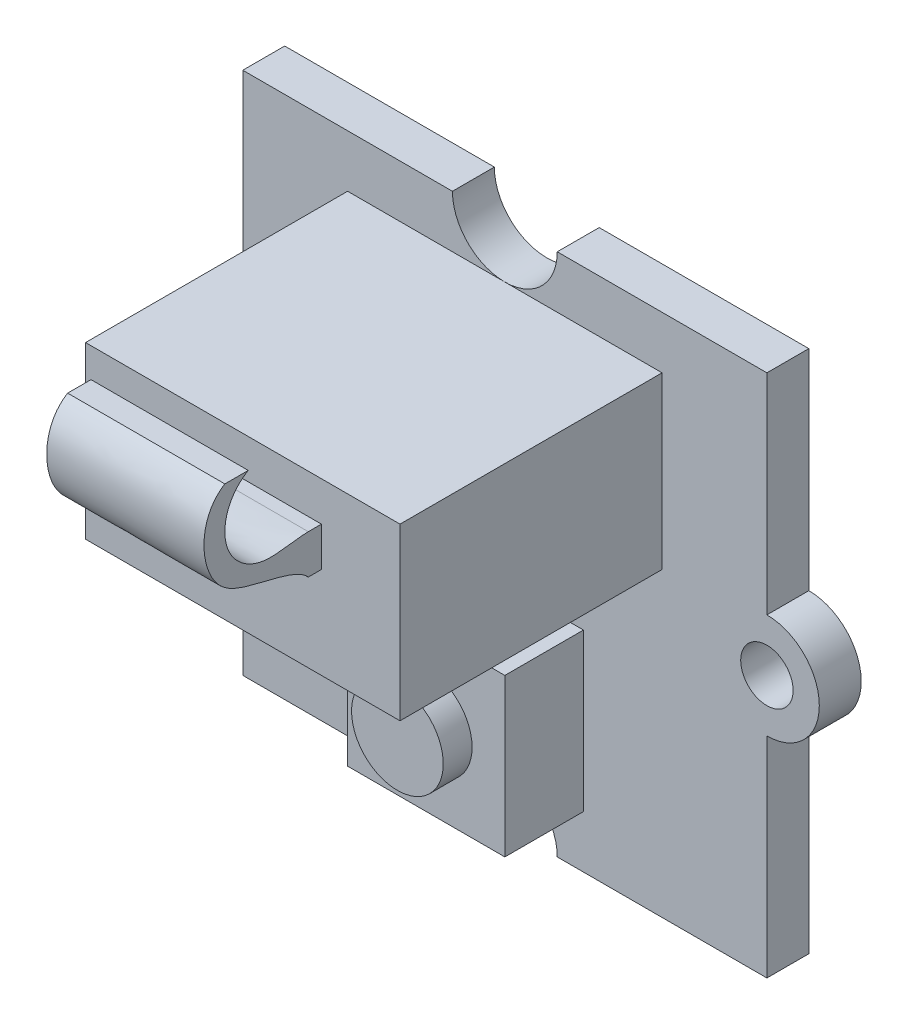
ISO-10303-21;
HEADER;
FILE_DESCRIPTION(('STEP AP214'),'2;1');
FILE_NAME('part.step','',(''),(''),'','','');
FILE_SCHEMA(('AUTOMOTIVE_DESIGN { 1 0 10303 214 1 1 1 1 }'));
ENDSEC;
DATA;
#1=APPLICATION_CONTEXT('core data for automotive mechanical design processes');
#2=APPLICATION_PROTOCOL_DEFINITION('international standard','automotive_design',2000,#1);
#3=PRODUCT_CONTEXT('',#1,'mechanical');
#4=PRODUCT('Part','Part','',(#3));
#5=PRODUCT_RELATED_PRODUCT_CATEGORY('part','',(#4));
#6=PRODUCT_DEFINITION_FORMATION('','',#4);
#7=PRODUCT_DEFINITION_CONTEXT('part definition',#1,'design');
#8=PRODUCT_DEFINITION('design','',#6,#7);
#9=PRODUCT_DEFINITION_SHAPE('','',#8);
#10=(LENGTH_UNIT() NAMED_UNIT(*) SI_UNIT(.MILLI.,.METRE.));
#11=(NAMED_UNIT(*) PLANE_ANGLE_UNIT() SI_UNIT($,.RADIAN.));
#12=(NAMED_UNIT(*) SI_UNIT($,.STERADIAN.) SOLID_ANGLE_UNIT());
#13=UNCERTAINTY_MEASURE_WITH_UNIT(LENGTH_MEASURE(1.E-05),#10,'distance_accuracy_value','');
#14=(GEOMETRIC_REPRESENTATION_CONTEXT(3) GLOBAL_UNCERTAINTY_ASSIGNED_CONTEXT((#13)) GLOBAL_UNIT_ASSIGNED_CONTEXT((#10,
#11,#12)) REPRESENTATION_CONTEXT('',''));
#15=CARTESIAN_POINT('',(0.,0.,0.));
#16=DIRECTION('',(0.,0.,1.));
#17=DIRECTION('',(1.,0.,0.));
#18=AXIS2_PLACEMENT_3D('',#15,#16,#17);
#19=CARTESIAN_POINT('',(0.,0.,11.6));
#20=DIRECTION('',(0.,0.,1.));
#21=DIRECTION('',(1.,0.,0.));
#22=AXIS2_PLACEMENT_3D('',#19,#20,#21);
#23=PLANE('',#22);
#24=DIRECTION('',(0.,-1.,0.));
#25=VECTOR('',#24,1.);
#26=CARTESIAN_POINT('',(-6.,8.,11.6));
#27=LINE('',#26,#25);
#28=CARTESIAN_POINT('',(-6.,8.,11.6));
#29=VERTEX_POINT('',#28);
#30=CARTESIAN_POINT('',(-6.,1.5,11.6));
#31=VERTEX_POINT('',#30);
#32=EDGE_CURVE('E486',#29,#31,#27,.T.);
#33=ORIENTED_EDGE('',*,*,#32,.T.);
#34=DIRECTION('',(1.,0.,0.));
#35=VECTOR('',#34,1.);
#36=CARTESIAN_POINT('',(-6.,1.5,11.6));
#37=LINE('',#36,#35);
#38=CARTESIAN_POINT('',(6.,1.5,11.6));
#39=VERTEX_POINT('',#38);
#40=EDGE_CURVE('E500',#31,#39,#37,.T.);
#41=ORIENTED_EDGE('',*,*,#40,.T.);
#42=DIRECTION('',(0.,1.,0.));
#43=VECTOR('',#42,1.);
#44=CARTESIAN_POINT('',(6.,8.,11.6));
#45=LINE('',#44,#43);
#46=CARTESIAN_POINT('',(6.,8.,11.6));
#47=VERTEX_POINT('',#46);
#48=EDGE_CURVE('E498',#39,#47,#45,.T.);
#49=ORIENTED_EDGE('',*,*,#48,.T.);
#50=DIRECTION('',(-1.,0.,0.));
#51=VECTOR('',#50,1.);
#52=CARTESIAN_POINT('',(-6.,8.,11.6));
#53=LINE('',#52,#51);
#54=EDGE_CURVE('E483',#47,#29,#53,.T.);
#55=ORIENTED_EDGE('',*,*,#54,.T.);
#56=EDGE_LOOP('',(#33,#41,#49,#55));
#57=FACE_BOUND('',#56,.T.);
#58=DIRECTION('',(-1.,0.,0.));
#59=VECTOR('',#58,1.);
#60=CARTESIAN_POINT('',(3.,6.5,11.6));
#61=LINE('',#60,#59);
#62=CARTESIAN_POINT('',(3.,6.5,11.6));
#63=VERTEX_POINT('',#62);
#64=CARTESIAN_POINT('',(-3.,6.5,11.6));
#65=VERTEX_POINT('',#64);
#66=EDGE_CURVE('E50',#63,#65,#61,.T.);
#67=ORIENTED_EDGE('',*,*,#66,.F.);
#68=DIRECTION('',(0.,-1.,0.));
#69=VECTOR('',#68,1.);
#70=CARTESIAN_POINT('',(3.,6.5,11.6));
#71=LINE('',#70,#69);
#72=CARTESIAN_POINT('',(3.,5.,11.6));
#73=VERTEX_POINT('',#72);
#74=EDGE_CURVE('E54',#63,#73,#71,.T.);
#75=ORIENTED_EDGE('',*,*,#74,.T.);
#76=DIRECTION('',(-1.,0.,0.));
#77=VECTOR('',#76,1.);
#78=CARTESIAN_POINT('',(3.,5.,11.6));
#79=LINE('',#78,#77);
#80=CARTESIAN_POINT('',(-3.,5.,11.6));
#81=VERTEX_POINT('',#80);
#82=EDGE_CURVE('E223',#73,#81,#79,.T.);
#83=ORIENTED_EDGE('',*,*,#82,.T.);
#84=DIRECTION('',(0.,-1.,0.));
#85=VECTOR('',#84,1.);
#86=CARTESIAN_POINT('',(-3.,6.5,11.6));
#87=LINE('',#86,#85);
#88=EDGE_CURVE('E530',#65,#81,#87,.T.);
#89=ORIENTED_EDGE('',*,*,#88,.F.);
#90=EDGE_LOOP('',(#67,#75,#83,#89));
#91=FACE_BOUND('',#90,.T.);
#92=ADVANCED_FACE('F35',(#57,#91),#23,.T.);
#93=CARTESIAN_POINT('',(-10.,0.,1.6));
#94=DIRECTION('',(0.,0.,1.));
#95=DIRECTION('',(1.,0.,0.));
#96=AXIS2_PLACEMENT_3D('',#93,#94,#95);
#97=PLANE('',#96);
#98=CARTESIAN_POINT('',(10.,0.,1.6));
#99=DIRECTION('',(0.,0.,1.));
#100=DIRECTION('',(-1.,0.,0.));
#101=AXIS2_PLACEMENT_3D('',#98,#99,#100);
#102=CIRCLE('',#101,1.);
#103=CARTESIAN_POINT('',(9.,0.,1.6));
#104=VERTEX_POINT('',#103);
#105=EDGE_CURVE('E795',#104,#104,#102,.T.);
#106=ORIENTED_EDGE('',*,*,#105,.F.);
#107=EDGE_LOOP('',(#106));
#108=FACE_BOUND('',#107,.T.);
#109=CARTESIAN_POINT('',(-10.,0.,1.6));
#110=DIRECTION('',(0.,0.,1.));
#111=DIRECTION('',(1.,0.,0.));
#112=AXIS2_PLACEMENT_3D('',#109,#110,#111);
#113=CIRCLE('',#112,1.);
#114=CARTESIAN_POINT('',(-9.,0.,1.6));
#115=VERTEX_POINT('',#114);
#116=EDGE_CURVE('E789',#115,#115,#113,.T.);
#117=ORIENTED_EDGE('',*,*,#116,.F.);
#118=EDGE_LOOP('',(#117));
#119=FACE_BOUND('',#118,.T.);
#120=DIRECTION('',(1.,0.,0.));
#121=VECTOR('',#120,1.);
#122=CARTESIAN_POINT('',(-6.,1.5,1.6));
#123=LINE('',#122,#121);
#124=CARTESIAN_POINT('',(-6.,1.5,1.6));
#125=VERTEX_POINT('',#124);
#126=CARTESIAN_POINT('',(6.,1.5,1.6));
#127=VERTEX_POINT('',#126);
#128=EDGE_CURVE('E491',#125,#127,#123,.T.);
#129=ORIENTED_EDGE('',*,*,#128,.F.);
#130=DIRECTION('',(0.,-1.,0.));
#131=VECTOR('',#130,1.);
#132=CARTESIAN_POINT('',(-6.,8.,1.6));
#133=LINE('',#132,#131);
#134=CARTESIAN_POINT('',(-6.,8.,1.6));
#135=VERTEX_POINT('',#134);
#136=EDGE_CURVE('E493',#135,#125,#133,.T.);
#137=ORIENTED_EDGE('',*,*,#136,.F.);
#138=DIRECTION('',(-1.,0.,0.));
#139=VECTOR('',#138,1.);
#140=CARTESIAN_POINT('',(-6.,8.,1.6));
#141=LINE('',#140,#139);
#142=CARTESIAN_POINT('',(0.,8.,1.6));
#143=VERTEX_POINT('',#142);
#144=EDGE_CURVE('E487',#143,#135,#141,.T.);
#145=ORIENTED_EDGE('',*,*,#144,.F.);
#146=CARTESIAN_POINT('',(0.,10.,1.6));
#147=DIRECTION('',(0.,0.,-1.));
#148=DIRECTION('',(1.,0.,0.));
#149=AXIS2_PLACEMENT_3D('',#146,#147,#148);
#150=CIRCLE('',#149,2.);
#151=CARTESIAN_POINT('',(-2.,10.,1.6));
#152=VERTEX_POINT('',#151);
#153=EDGE_CURVE('E784',#143,#152,#150,.T.);
#154=ORIENTED_EDGE('',*,*,#153,.T.);
#155=DIRECTION('',(-1.,0.,0.));
#156=VECTOR('',#155,1.);
#157=CARTESIAN_POINT('',(-10.,10.,1.6));
#158=LINE('',#157,#156);
#159=CARTESIAN_POINT('',(-10.,10.,1.6));
#160=VERTEX_POINT('',#159);
#161=EDGE_CURVE('E419',#152,#160,#158,.T.);
#162=ORIENTED_EDGE('',*,*,#161,.T.);
#163=DIRECTION('',(0.,-1.,0.));
#164=VECTOR('',#163,1.);
#165=CARTESIAN_POINT('',(-10.,10.,1.6));
#166=LINE('',#165,#164);
#167=CARTESIAN_POINT('',(-10.,2.,1.6));
#168=VERTEX_POINT('',#167);
#169=EDGE_CURVE('E414',#160,#168,#166,.T.);
#170=ORIENTED_EDGE('',*,*,#169,.T.);
#171=CARTESIAN_POINT('',(-10.,0.,1.6));
#172=DIRECTION('',(0.,0.,1.));
#173=DIRECTION('',(1.,0.,0.));
#174=AXIS2_PLACEMENT_3D('',#171,#172,#173);
#175=CIRCLE('',#174,2.);
#176=CARTESIAN_POINT('',(-10.,-2.,1.6));
#177=VERTEX_POINT('',#176);
#178=EDGE_CURVE('E803',#168,#177,#175,.T.);
#179=ORIENTED_EDGE('',*,*,#178,.T.);
#180=DIRECTION('',(0.,-1.,0.));
#181=VECTOR('',#180,1.);
#182=CARTESIAN_POINT('',(-10.,-10.,1.6));
#183=LINE('',#182,#181);
#184=CARTESIAN_POINT('',(-10.,-10.,1.6));
#185=VERTEX_POINT('',#184);
#186=EDGE_CURVE('E387',#177,#185,#183,.T.);
#187=ORIENTED_EDGE('',*,*,#186,.T.);
#188=DIRECTION('',(1.,0.,0.));
#189=VECTOR('',#188,1.);
#190=CARTESIAN_POINT('',(-10.,-10.,1.6));
#191=LINE('',#190,#189);
#192=CARTESIAN_POINT('',(-2.,-10.,1.6));
#193=VERTEX_POINT('',#192);
#194=EDGE_CURVE('E806',#185,#193,#191,.T.);
#195=ORIENTED_EDGE('',*,*,#194,.T.);
#196=CARTESIAN_POINT('',(0.,-10.,1.6));
#197=DIRECTION('',(0.,0.,-1.));
#198=DIRECTION('',(1.,0.,0.));
#199=AXIS2_PLACEMENT_3D('',#196,#197,#198);
#200=CIRCLE('',#199,2.);
#201=CARTESIAN_POINT('',(0.,-8.00000000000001,1.6));
#202=VERTEX_POINT('',#201);
#203=EDGE_CURVE('E809',#193,#202,#200,.T.);
#204=ORIENTED_EDGE('',*,*,#203,.T.);
#205=DIRECTION('',(1.,0.,0.));
#206=VECTOR('',#205,1.);
#207=CARTESIAN_POINT('',(-3.,-8.00000000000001,1.6));
#208=LINE('',#207,#206);
#209=CARTESIAN_POINT('',(-3.,-8.00000000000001,1.6));
#210=VERTEX_POINT('',#209);
#211=EDGE_CURVE('E445',#210,#202,#208,.T.);
#212=ORIENTED_EDGE('',*,*,#211,.F.);
#213=DIRECTION('',(0.,-1.,0.));
#214=VECTOR('',#213,1.);
#215=CARTESIAN_POINT('',(-3.,-2.00000000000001,1.6));
#216=LINE('',#215,#214);
#217=CARTESIAN_POINT('',(-3.,-2.00000000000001,1.6));
#218=VERTEX_POINT('',#217);
#219=EDGE_CURVE('E452',#218,#210,#216,.T.);
#220=ORIENTED_EDGE('',*,*,#219,.F.);
#221=DIRECTION('',(-1.,0.,0.));
#222=VECTOR('',#221,1.);
#223=CARTESIAN_POINT('',(-3.,-2.00000000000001,1.6));
#224=LINE('',#223,#222);
#225=CARTESIAN_POINT('',(3.,-2.00000000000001,1.6));
#226=VERTEX_POINT('',#225);
#227=EDGE_CURVE('E455',#226,#218,#224,.T.);
#228=ORIENTED_EDGE('',*,*,#227,.F.);
#229=DIRECTION('',(0.,1.,0.));
#230=VECTOR('',#229,1.);
#231=CARTESIAN_POINT('',(3.,-2.00000000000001,1.6));
#232=LINE('',#231,#230);
#233=CARTESIAN_POINT('',(3.,-8.00000000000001,1.6));
#234=VERTEX_POINT('',#233);
#235=EDGE_CURVE('E451',#234,#226,#232,.T.);
#236=ORIENTED_EDGE('',*,*,#235,.F.);
#237=EDGE_CURVE('E43',#202,#234,#208,.T.);
#238=ORIENTED_EDGE('',*,*,#237,.F.);
#239=CARTESIAN_POINT('',(2.,-10.,1.6));
#240=VERTEX_POINT('',#239);
#241=EDGE_CURVE('E808',#202,#240,#200,.T.);
#242=ORIENTED_EDGE('',*,*,#241,.T.);
#243=DIRECTION('',(1.,0.,0.));
#244=VECTOR('',#243,1.);
#245=CARTESIAN_POINT('',(10.,-10.,1.6));
#246=LINE('',#245,#244);
#247=CARTESIAN_POINT('',(10.,-10.,1.6));
#248=VERTEX_POINT('',#247);
#249=EDGE_CURVE('E812',#240,#248,#246,.T.);
#250=ORIENTED_EDGE('',*,*,#249,.T.);
#251=DIRECTION('',(0.,1.,0.));
#252=VECTOR('',#251,1.);
#253=CARTESIAN_POINT('',(10.,-10.,1.6));
#254=LINE('',#253,#252);
#255=CARTESIAN_POINT('',(10.,-2.00000000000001,1.6));
#256=VERTEX_POINT('',#255);
#257=EDGE_CURVE('E814',#248,#256,#254,.T.);
#258=ORIENTED_EDGE('',*,*,#257,.T.);
#259=CARTESIAN_POINT('',(10.,0.,1.6));
#260=DIRECTION('',(0.,0.,1.));
#261=DIRECTION('',(-1.,0.,0.));
#262=AXIS2_PLACEMENT_3D('',#259,#260,#261);
#263=CIRCLE('',#262,2.);
#264=CARTESIAN_POINT('',(10.,1.99999999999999,1.6));
#265=VERTEX_POINT('',#264);
#266=EDGE_CURVE('E816',#256,#265,#263,.T.);
#267=ORIENTED_EDGE('',*,*,#266,.T.);
#268=DIRECTION('',(0.,1.,0.));
#269=VECTOR('',#268,1.);
#270=CARTESIAN_POINT('',(10.,9.99999999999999,1.6));
#271=LINE('',#270,#269);
#272=CARTESIAN_POINT('',(10.,9.99999999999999,1.6));
#273=VERTEX_POINT('',#272);
#274=EDGE_CURVE('E817',#265,#273,#271,.T.);
#275=ORIENTED_EDGE('',*,*,#274,.T.);
#276=DIRECTION('',(-1.,0.,0.));
#277=VECTOR('',#276,1.);
#278=CARTESIAN_POINT('',(10.,9.99999999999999,1.6));
#279=LINE('',#278,#277);
#280=CARTESIAN_POINT('',(2.,10.,1.6));
#281=VERTEX_POINT('',#280);
#282=EDGE_CURVE('E782',#273,#281,#279,.T.);
#283=ORIENTED_EDGE('',*,*,#282,.T.);
#284=EDGE_CURVE('E780',#281,#143,#150,.T.);
#285=ORIENTED_EDGE('',*,*,#284,.T.);
#286=CARTESIAN_POINT('',(6.,8.,1.6));
#287=VERTEX_POINT('',#286);
#288=EDGE_CURVE('E484',#287,#143,#141,.T.);
#289=ORIENTED_EDGE('',*,*,#288,.F.);
#290=DIRECTION('',(0.,1.,0.));
#291=VECTOR('',#290,1.);
#292=CARTESIAN_POINT('',(6.,8.,1.6));
#293=LINE('',#292,#291);
#294=EDGE_CURVE('E488',#127,#287,#293,.T.);
#295=ORIENTED_EDGE('',*,*,#294,.F.);
#296=EDGE_LOOP('',(#129,#137,#145,#154,#162,#170,#179,#187,#195,#204,#212,#220,#228,#236,#238,
#242,#250,#258,#267,#275,#283,#285,#289,#295));
#297=FACE_BOUND('',#296,.T.);
#298=ADVANCED_FACE('F264',(#108,#119,#297),#97,.T.);
#299=CARTESIAN_POINT('',(-10.,0.,0.));
#300=DIRECTION('',(0.,0.,1.));
#301=DIRECTION('',(1.,0.,0.));
#302=AXIS2_PLACEMENT_3D('',#299,#300,#301);
#303=PLANE('',#302);
#304=CARTESIAN_POINT('',(-10.,0.,0.));
#305=DIRECTION('',(0.,0.,1.));
#306=DIRECTION('',(1.,0.,0.));
#307=AXIS2_PLACEMENT_3D('',#304,#305,#306);
#308=CIRCLE('',#307,1.);
#309=CARTESIAN_POINT('',(-9.,0.,0.));
#310=VERTEX_POINT('',#309);
#311=EDGE_CURVE('E791',#310,#310,#308,.T.);
#312=ORIENTED_EDGE('',*,*,#311,.T.);
#313=EDGE_LOOP('',(#312));
#314=FACE_BOUND('',#313,.T.);
#315=DIRECTION('',(0.,-1.,0.));
#316=VECTOR('',#315,1.);
#317=CARTESIAN_POINT('',(-10.,10.,0.));
#318=LINE('',#317,#316);
#319=CARTESIAN_POINT('',(-10.,10.,0.));
#320=VERTEX_POINT('',#319);
#321=CARTESIAN_POINT('',(-10.,2.,0.));
#322=VERTEX_POINT('',#321);
#323=EDGE_CURVE('E383',#320,#322,#318,.T.);
#324=ORIENTED_EDGE('',*,*,#323,.F.);
#325=DIRECTION('',(-1.,0.,0.));
#326=VECTOR('',#325,1.);
#327=CARTESIAN_POINT('',(-10.,10.,0.));
#328=LINE('',#327,#326);
#329=CARTESIAN_POINT('',(-2.,10.,0.));
#330=VERTEX_POINT('',#329);
#331=EDGE_CURVE('E412',#330,#320,#328,.T.);
#332=ORIENTED_EDGE('',*,*,#331,.F.);
#333=CARTESIAN_POINT('',(0.,10.,0.));
#334=DIRECTION('',(0.,0.,-1.));
#335=DIRECTION('',(1.,0.,0.));
#336=AXIS2_PLACEMENT_3D('',#333,#334,#335);
#337=CIRCLE('',#336,2.);
#338=CARTESIAN_POINT('',(2.,10.,0.));
#339=VERTEX_POINT('',#338);
#340=EDGE_CURVE('E410',#339,#330,#337,.T.);
#341=ORIENTED_EDGE('',*,*,#340,.F.);
#342=DIRECTION('',(-1.,0.,0.));
#343=VECTOR('',#342,1.);
#344=CARTESIAN_POINT('',(10.,9.99999999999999,0.));
#345=LINE('',#344,#343);
#346=CARTESIAN_POINT('',(10.,9.99999999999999,0.));
#347=VERTEX_POINT('',#346);
#348=EDGE_CURVE('E408',#347,#339,#345,.T.);
#349=ORIENTED_EDGE('',*,*,#348,.F.);
#350=DIRECTION('',(0.,1.,0.));
#351=VECTOR('',#350,1.);
#352=CARTESIAN_POINT('',(10.,9.99999999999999,0.));
#353=LINE('',#352,#351);
#354=CARTESIAN_POINT('',(10.,1.99999999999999,0.));
#355=VERTEX_POINT('',#354);
#356=EDGE_CURVE('E406',#355,#347,#353,.T.);
#357=ORIENTED_EDGE('',*,*,#356,.F.);
#358=CARTESIAN_POINT('',(10.,0.,0.));
#359=DIRECTION('',(0.,0.,1.));
#360=DIRECTION('',(-1.,0.,0.));
#361=AXIS2_PLACEMENT_3D('',#358,#359,#360);
#362=CIRCLE('',#361,2.);
#363=CARTESIAN_POINT('',(10.,-2.00000000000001,0.));
#364=VERTEX_POINT('',#363);
#365=EDGE_CURVE('E404',#364,#355,#362,.T.);
#366=ORIENTED_EDGE('',*,*,#365,.F.);
#367=DIRECTION('',(0.,1.,0.));
#368=VECTOR('',#367,1.);
#369=CARTESIAN_POINT('',(10.,-10.,0.));
#370=LINE('',#369,#368);
#371=CARTESIAN_POINT('',(10.,-10.,0.));
#372=VERTEX_POINT('',#371);
#373=EDGE_CURVE('E402',#372,#364,#370,.T.);
#374=ORIENTED_EDGE('',*,*,#373,.F.);
#375=DIRECTION('',(1.,0.,0.));
#376=VECTOR('',#375,1.);
#377=CARTESIAN_POINT('',(10.,-10.,0.));
#378=LINE('',#377,#376);
#379=CARTESIAN_POINT('',(2.,-10.,0.));
#380=VERTEX_POINT('',#379);
#381=EDGE_CURVE('E400',#380,#372,#378,.T.);
#382=ORIENTED_EDGE('',*,*,#381,.F.);
#383=CARTESIAN_POINT('',(0.,-10.,0.));
#384=DIRECTION('',(0.,0.,-1.));
#385=DIRECTION('',(1.,0.,0.));
#386=AXIS2_PLACEMENT_3D('',#383,#384,#385);
#387=CIRCLE('',#386,2.);
#388=CARTESIAN_POINT('',(-2.,-10.,0.));
#389=VERTEX_POINT('',#388);
#390=EDGE_CURVE('E395',#389,#380,#387,.T.);
#391=ORIENTED_EDGE('',*,*,#390,.F.);
#392=DIRECTION('',(1.,0.,0.));
#393=VECTOR('',#392,1.);
#394=CARTESIAN_POINT('',(-10.,-10.,0.));
#395=LINE('',#394,#393);
#396=CARTESIAN_POINT('',(-10.,-10.,0.));
#397=VERTEX_POINT('',#396);
#398=EDGE_CURVE('E393',#397,#389,#395,.T.);
#399=ORIENTED_EDGE('',*,*,#398,.F.);
#400=DIRECTION('',(0.,-1.,0.));
#401=VECTOR('',#400,1.);
#402=CARTESIAN_POINT('',(-10.,-10.,0.));
#403=LINE('',#402,#401);
#404=CARTESIAN_POINT('',(-10.,-2.,0.));
#405=VERTEX_POINT('',#404);
#406=EDGE_CURVE('E382',#405,#397,#403,.T.);
#407=ORIENTED_EDGE('',*,*,#406,.F.);
#408=CARTESIAN_POINT('',(-10.,0.,0.));
#409=DIRECTION('',(0.,0.,1.));
#410=DIRECTION('',(1.,0.,0.));
#411=AXIS2_PLACEMENT_3D('',#408,#409,#410);
#412=CIRCLE('',#411,2.);
#413=EDGE_CURVE('E372',#322,#405,#412,.T.);
#414=ORIENTED_EDGE('',*,*,#413,.F.);
#415=EDGE_LOOP('',(#324,#332,#341,#349,#357,#366,#374,#382,#391,#399,#407,#414));
#416=FACE_BOUND('',#415,.T.);
#417=CARTESIAN_POINT('',(10.,0.,0.));
#418=DIRECTION('',(0.,0.,1.));
#419=DIRECTION('',(-1.,0.,0.));
#420=AXIS2_PLACEMENT_3D('',#417,#418,#419);
#421=CIRCLE('',#420,1.);
#422=CARTESIAN_POINT('',(9.,0.,0.));
#423=VERTEX_POINT('',#422);
#424=EDGE_CURVE('E798',#423,#423,#421,.T.);
#425=ORIENTED_EDGE('',*,*,#424,.T.);
#426=EDGE_LOOP('',(#425));
#427=FACE_BOUND('',#426,.T.);
#428=ADVANCED_FACE('F320',(#314,#416,#427),#303,.F.);
#429=CARTESIAN_POINT('',(-10.,10.,1.6));
#430=DIRECTION('',(1.,0.,0.));
#431=DIRECTION('',(0.,0.,-1.));
#432=AXIS2_PLACEMENT_3D('',#429,#430,#431);
#433=PLANE('',#432);
#434=ORIENTED_EDGE('',*,*,#323,.T.);
#435=DIRECTION('',(0.,0.,-1.));
#436=VECTOR('',#435,1.);
#437=CARTESIAN_POINT('',(-10.,2.,1.6));
#438=LINE('',#437,#436);
#439=EDGE_CURVE('E377',#168,#322,#438,.T.);
#440=ORIENTED_EDGE('',*,*,#439,.F.);
#441=ORIENTED_EDGE('',*,*,#169,.F.);
#442=DIRECTION('',(0.,0.,-1.));
#443=VECTOR('',#442,1.);
#444=CARTESIAN_POINT('',(-10.,10.,1.6));
#445=LINE('',#444,#443);
#446=EDGE_CURVE('E415',#160,#320,#445,.T.);
#447=ORIENTED_EDGE('',*,*,#446,.T.);
#448=EDGE_LOOP('',(#434,#440,#441,#447));
#449=FACE_BOUND('',#448,.T.);
#450=ADVANCED_FACE('F37',(#449),#433,.F.);
#451=CARTESIAN_POINT('',(-10.,0.,1.6));
#452=DIRECTION('',(0.,0.,-1.));
#453=DIRECTION('',(-1.,0.,0.));
#454=AXIS2_PLACEMENT_3D('',#451,#452,#453);
#455=CYLINDRICAL_SURFACE('',#454,2.);
#456=ORIENTED_EDGE('',*,*,#413,.T.);
#457=DIRECTION('',(0.,0.,-1.));
#458=VECTOR('',#457,1.);
#459=CARTESIAN_POINT('',(-10.,-2.,1.6));
#460=LINE('',#459,#458);
#461=EDGE_CURVE('E374',#177,#405,#460,.T.);
#462=ORIENTED_EDGE('',*,*,#461,.F.);
#463=ORIENTED_EDGE('',*,*,#178,.F.);
#464=ORIENTED_EDGE('',*,*,#439,.T.);
#465=EDGE_LOOP('',(#456,#462,#463,#464));
#466=FACE_BOUND('',#465,.T.);
#467=ADVANCED_FACE('F362',(#466),#455,.T.);
#468=CARTESIAN_POINT('',(-10.,-10.,1.6));
#469=DIRECTION('',(1.,0.,0.));
#470=DIRECTION('',(0.,0.,-1.));
#471=AXIS2_PLACEMENT_3D('',#468,#469,#470);
#472=PLANE('',#471);
#473=ORIENTED_EDGE('',*,*,#406,.T.);
#474=DIRECTION('',(0.,0.,-1.));
#475=VECTOR('',#474,1.);
#476=CARTESIAN_POINT('',(-10.,-10.,1.6));
#477=LINE('',#476,#475);
#478=EDGE_CURVE('E388',#185,#397,#477,.T.);
#479=ORIENTED_EDGE('',*,*,#478,.F.);
#480=ORIENTED_EDGE('',*,*,#186,.F.);
#481=ORIENTED_EDGE('',*,*,#461,.T.);
#482=EDGE_LOOP('',(#473,#479,#480,#481));
#483=FACE_BOUND('',#482,.T.);
#484=ADVANCED_FACE('F359',(#483),#472,.F.);
#485=CARTESIAN_POINT('',(-10.,-10.,1.6));
#486=DIRECTION('',(0.,1.,0.));
#487=DIRECTION('',(0.,0.,1.));
#488=AXIS2_PLACEMENT_3D('',#485,#486,#487);
#489=PLANE('',#488);
#490=ORIENTED_EDGE('',*,*,#398,.T.);
#491=DIRECTION('',(0.,0.,-1.));
#492=VECTOR('',#491,1.);
#493=CARTESIAN_POINT('',(-2.,-10.,1.6));
#494=LINE('',#493,#492);
#495=EDGE_CURVE('E440',#193,#389,#494,.T.);
#496=ORIENTED_EDGE('',*,*,#495,.F.);
#497=ORIENTED_EDGE('',*,*,#194,.F.);
#498=ORIENTED_EDGE('',*,*,#478,.T.);
#499=EDGE_LOOP('',(#490,#496,#497,#498));
#500=FACE_BOUND('',#499,.T.);
#501=ADVANCED_FACE('F355',(#500),#489,.F.);
#502=CARTESIAN_POINT('',(0.,-10.,1.6));
#503=DIRECTION('',(0.,0.,-1.));
#504=DIRECTION('',(-1.,0.,0.));
#505=AXIS2_PLACEMENT_3D('',#502,#503,#504);
#506=CYLINDRICAL_SURFACE('',#505,2.);
#507=ORIENTED_EDGE('',*,*,#390,.T.);
#508=DIRECTION('',(0.,0.,-1.));
#509=VECTOR('',#508,1.);
#510=CARTESIAN_POINT('',(2.,-10.,1.6));
#511=LINE('',#510,#509);
#512=EDGE_CURVE('E437',#240,#380,#511,.T.);
#513=ORIENTED_EDGE('',*,*,#512,.F.);
#514=ORIENTED_EDGE('',*,*,#241,.F.);
#515=ORIENTED_EDGE('',*,*,#203,.F.);
#516=ORIENTED_EDGE('',*,*,#495,.T.);
#517=EDGE_LOOP('',(#507,#513,#514,#515,#516));
#518=FACE_BOUND('',#517,.T.);
#519=ADVANCED_FACE('F351',(#518),#506,.F.);
#520=CARTESIAN_POINT('',(10.,-10.,1.6));
#521=DIRECTION('',(0.,1.,0.));
#522=DIRECTION('',(-1.,0.,0.));
#523=AXIS2_PLACEMENT_3D('',#520,#521,#522);
#524=PLANE('',#523);
#525=ORIENTED_EDGE('',*,*,#381,.T.);
#526=DIRECTION('',(0.,0.,-1.));
#527=VECTOR('',#526,1.);
#528=CARTESIAN_POINT('',(10.,-10.,1.6));
#529=LINE('',#528,#527);
#530=EDGE_CURVE('E434',#248,#372,#529,.T.);
#531=ORIENTED_EDGE('',*,*,#530,.F.);
#532=ORIENTED_EDGE('',*,*,#249,.F.);
#533=ORIENTED_EDGE('',*,*,#512,.T.);
#534=EDGE_LOOP('',(#525,#531,#532,#533));
#535=FACE_BOUND('',#534,.T.);
#536=ADVANCED_FACE('F347',(#535),#524,.F.);
#537=CARTESIAN_POINT('',(10.,-10.,1.6));
#538=DIRECTION('',(-1.,0.,0.));
#539=DIRECTION('',(0.,0.,1.));
#540=AXIS2_PLACEMENT_3D('',#537,#538,#539);
#541=PLANE('',#540);
#542=ORIENTED_EDGE('',*,*,#373,.T.);
#543=DIRECTION('',(0.,0.,-1.));
#544=VECTOR('',#543,1.);
#545=CARTESIAN_POINT('',(10.,-2.00000000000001,1.6));
#546=LINE('',#545,#544);
#547=EDGE_CURVE('E431',#256,#364,#546,.T.);
#548=ORIENTED_EDGE('',*,*,#547,.F.);
#549=ORIENTED_EDGE('',*,*,#257,.F.);
#550=ORIENTED_EDGE('',*,*,#530,.T.);
#551=EDGE_LOOP('',(#542,#548,#549,#550));
#552=FACE_BOUND('',#551,.T.);
#553=ADVANCED_FACE('F343',(#552),#541,.F.);
#554=CARTESIAN_POINT('',(10.,0.,1.6));
#555=DIRECTION('',(0.,0.,-1.));
#556=DIRECTION('',(-1.,0.,0.));
#557=AXIS2_PLACEMENT_3D('',#554,#555,#556);
#558=CYLINDRICAL_SURFACE('',#557,2.);
#559=ORIENTED_EDGE('',*,*,#365,.T.);
#560=DIRECTION('',(0.,0.,-1.));
#561=VECTOR('',#560,1.);
#562=CARTESIAN_POINT('',(10.,1.99999999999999,1.6));
#563=LINE('',#562,#561);
#564=EDGE_CURVE('E428',#265,#355,#563,.T.);
#565=ORIENTED_EDGE('',*,*,#564,.F.);
#566=ORIENTED_EDGE('',*,*,#266,.F.);
#567=ORIENTED_EDGE('',*,*,#547,.T.);
#568=EDGE_LOOP('',(#559,#565,#566,#567));
#569=FACE_BOUND('',#568,.T.);
#570=ADVANCED_FACE('F339',(#569),#558,.T.);
#571=CARTESIAN_POINT('',(10.,9.99999999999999,1.6));
#572=DIRECTION('',(-1.,0.,0.));
#573=DIRECTION('',(0.,0.,1.));
#574=AXIS2_PLACEMENT_3D('',#571,#572,#573);
#575=PLANE('',#574);
#576=ORIENTED_EDGE('',*,*,#356,.T.);
#577=DIRECTION('',(0.,0.,-1.));
#578=VECTOR('',#577,1.);
#579=CARTESIAN_POINT('',(10.,9.99999999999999,1.6));
#580=LINE('',#579,#578);
#581=EDGE_CURVE('E425',#273,#347,#580,.T.);
#582=ORIENTED_EDGE('',*,*,#581,.F.);
#583=ORIENTED_EDGE('',*,*,#274,.F.);
#584=ORIENTED_EDGE('',*,*,#564,.T.);
#585=EDGE_LOOP('',(#576,#582,#583,#584));
#586=FACE_BOUND('',#585,.T.);
#587=ADVANCED_FACE('F335',(#586),#575,.F.);
#588=CARTESIAN_POINT('',(10.,9.99999999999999,1.6));
#589=DIRECTION('',(0.,-1.,0.));
#590=DIRECTION('',(1.,0.,0.));
#591=AXIS2_PLACEMENT_3D('',#588,#589,#590);
#592=PLANE('',#591);
#593=ORIENTED_EDGE('',*,*,#348,.T.);
#594=DIRECTION('',(0.,0.,-1.));
#595=VECTOR('',#594,1.);
#596=CARTESIAN_POINT('',(2.,10.,1.6));
#597=LINE('',#596,#595);
#598=EDGE_CURVE('E422',#281,#339,#597,.T.);
#599=ORIENTED_EDGE('',*,*,#598,.F.);
#600=ORIENTED_EDGE('',*,*,#282,.F.);
#601=ORIENTED_EDGE('',*,*,#581,.T.);
#602=EDGE_LOOP('',(#593,#599,#600,#601));
#603=FACE_BOUND('',#602,.T.);
#604=ADVANCED_FACE('F331',(#603),#592,.F.);
#605=CARTESIAN_POINT('',(0.,10.,1.6));
#606=DIRECTION('',(0.,0.,-1.));
#607=DIRECTION('',(-1.,0.,0.));
#608=AXIS2_PLACEMENT_3D('',#605,#606,#607);
#609=CYLINDRICAL_SURFACE('',#608,2.);
#610=ORIENTED_EDGE('',*,*,#340,.T.);
#611=DIRECTION('',(0.,0.,-1.));
#612=VECTOR('',#611,1.);
#613=CARTESIAN_POINT('',(-2.,10.,1.6));
#614=LINE('',#613,#612);
#615=EDGE_CURVE('E418',#152,#330,#614,.T.);
#616=ORIENTED_EDGE('',*,*,#615,.F.);
#617=ORIENTED_EDGE('',*,*,#153,.F.);
#618=ORIENTED_EDGE('',*,*,#284,.F.);
#619=ORIENTED_EDGE('',*,*,#598,.T.);
#620=EDGE_LOOP('',(#610,#616,#617,#618,#619));
#621=FACE_BOUND('',#620,.T.);
#622=ADVANCED_FACE('F327',(#621),#609,.F.);
#623=CARTESIAN_POINT('',(-10.,10.,1.6));
#624=DIRECTION('',(0.,-1.,0.));
#625=DIRECTION('',(0.,0.,-1.));
#626=AXIS2_PLACEMENT_3D('',#623,#624,#625);
#627=PLANE('',#626);
#628=ORIENTED_EDGE('',*,*,#331,.T.);
#629=ORIENTED_EDGE('',*,*,#446,.F.);
#630=ORIENTED_EDGE('',*,*,#161,.F.);
#631=ORIENTED_EDGE('',*,*,#615,.T.);
#632=EDGE_LOOP('',(#628,#629,#630,#631));
#633=FACE_BOUND('',#632,.T.);
#634=ADVANCED_FACE('F316',(#633),#627,.F.);
#635=CARTESIAN_POINT('',(-10.,0.,1.6));
#636=DIRECTION('',(0.,0.,-1.));
#637=DIRECTION('',(-1.,0.,0.));
#638=AXIS2_PLACEMENT_3D('',#635,#636,#637);
#639=CYLINDRICAL_SURFACE('',#638,1.);
#640=ORIENTED_EDGE('',*,*,#116,.T.);
#641=EDGE_LOOP('',(#640));
#642=FACE_BOUND('',#641,.T.);
#643=ORIENTED_EDGE('',*,*,#311,.F.);
#644=EDGE_LOOP('',(#643));
#645=FACE_BOUND('',#644,.T.);
#646=ADVANCED_FACE('F312',(#642,#645),#639,.F.);
#647=CARTESIAN_POINT('',(10.,0.,1.6));
#648=DIRECTION('',(0.,0.,-1.));
#649=DIRECTION('',(-1.,0.,0.));
#650=AXIS2_PLACEMENT_3D('',#647,#648,#649);
#651=CYLINDRICAL_SURFACE('',#650,1.);
#652=ORIENTED_EDGE('',*,*,#105,.T.);
#653=EDGE_LOOP('',(#652));
#654=FACE_BOUND('',#653,.T.);
#655=ORIENTED_EDGE('',*,*,#424,.F.);
#656=EDGE_LOOP('',(#655));
#657=FACE_BOUND('',#656,.T.);
#658=ADVANCED_FACE('F308',(#654,#657),#651,.F.);
#659=CARTESIAN_POINT('',(-3.,-2.00000000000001,4.6));
#660=DIRECTION('',(1.,0.,0.));
#661=DIRECTION('',(0.,1.,0.));
#662=AXIS2_PLACEMENT_3D('',#659,#660,#661);
#663=PLANE('',#662);
#664=ORIENTED_EDGE('',*,*,#219,.T.);
#665=DIRECTION('',(0.,0.,-1.));
#666=VECTOR('',#665,1.);
#667=CARTESIAN_POINT('',(-3.,-8.00000000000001,4.6));
#668=LINE('',#667,#666);
#669=CARTESIAN_POINT('',(-3.,-8.00000000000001,4.6));
#670=VERTEX_POINT('',#669);
#671=EDGE_CURVE('E836',#670,#210,#668,.T.);
#672=ORIENTED_EDGE('',*,*,#671,.F.);
#673=DIRECTION('',(0.,-1.,0.));
#674=VECTOR('',#673,1.);
#675=CARTESIAN_POINT('',(-3.,-2.00000000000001,4.6));
#676=LINE('',#675,#674);
#677=CARTESIAN_POINT('',(-3.,-2.00000000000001,4.6));
#678=VERTEX_POINT('',#677);
#679=EDGE_CURVE('E471',#678,#670,#676,.T.);
#680=ORIENTED_EDGE('',*,*,#679,.F.);
#681=DIRECTION('',(0.,0.,-1.));
#682=VECTOR('',#681,1.);
#683=CARTESIAN_POINT('',(-3.,-2.00000000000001,4.6));
#684=LINE('',#683,#682);
#685=EDGE_CURVE('E466',#678,#218,#684,.T.);
#686=ORIENTED_EDGE('',*,*,#685,.T.);
#687=EDGE_LOOP('',(#664,#672,#680,#686));
#688=FACE_BOUND('',#687,.T.);
#689=ADVANCED_FACE('F304',(#688),#663,.F.);
#690=CARTESIAN_POINT('',(-3.,-8.00000000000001,4.6));
#691=DIRECTION('',(0.,1.,0.));
#692=DIRECTION('',(0.,0.,1.));
#693=AXIS2_PLACEMENT_3D('',#690,#691,#692);
#694=PLANE('',#693);
#695=ORIENTED_EDGE('',*,*,#211,.T.);
#696=ORIENTED_EDGE('',*,*,#237,.T.);
#697=DIRECTION('',(0.,0.,-1.));
#698=VECTOR('',#697,1.);
#699=CARTESIAN_POINT('',(3.,-8.00000000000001,4.6));
#700=LINE('',#699,#698);
#701=CARTESIAN_POINT('',(3.,-8.00000000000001,4.6));
#702=VERTEX_POINT('',#701);
#703=EDGE_CURVE('E838',#702,#234,#700,.T.);
#704=ORIENTED_EDGE('',*,*,#703,.F.);
#705=DIRECTION('',(1.,0.,0.));
#706=VECTOR('',#705,1.);
#707=CARTESIAN_POINT('',(-3.,-8.00000000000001,4.6));
#708=LINE('',#707,#706);
#709=EDGE_CURVE('E469',#670,#702,#708,.T.);
#710=ORIENTED_EDGE('',*,*,#709,.F.);
#711=ORIENTED_EDGE('',*,*,#671,.T.);
#712=EDGE_LOOP('',(#695,#696,#704,#710,#711));
#713=FACE_BOUND('',#712,.T.);
#714=ADVANCED_FACE('F300',(#713),#694,.F.);
#715=CARTESIAN_POINT('',(3.,-2.00000000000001,4.6));
#716=DIRECTION('',(-1.,0.,0.));
#717=DIRECTION('',(0.,-1.,0.));
#718=AXIS2_PLACEMENT_3D('',#715,#716,#717);
#719=PLANE('',#718);
#720=ORIENTED_EDGE('',*,*,#235,.T.);
#721=DIRECTION('',(0.,0.,-1.));
#722=VECTOR('',#721,1.);
#723=CARTESIAN_POINT('',(3.,-2.00000000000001,4.6));
#724=LINE('',#723,#722);
#725=CARTESIAN_POINT('',(3.,-2.00000000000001,4.6));
#726=VERTEX_POINT('',#725);
#727=EDGE_CURVE('E841',#726,#226,#724,.T.);
#728=ORIENTED_EDGE('',*,*,#727,.F.);
#729=DIRECTION('',(0.,1.,0.));
#730=VECTOR('',#729,1.);
#731=CARTESIAN_POINT('',(3.,-2.00000000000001,4.6));
#732=LINE('',#731,#730);
#733=EDGE_CURVE('E467',#702,#726,#732,.T.);
#734=ORIENTED_EDGE('',*,*,#733,.F.);
#735=ORIENTED_EDGE('',*,*,#703,.T.);
#736=EDGE_LOOP('',(#720,#728,#734,#735));
#737=FACE_BOUND('',#736,.T.);
#738=ADVANCED_FACE('F296',(#737),#719,.F.);
#739=CARTESIAN_POINT('',(-3.,-2.00000000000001,4.6));
#740=DIRECTION('',(0.,-1.,0.));
#741=DIRECTION('',(0.,0.,-1.));
#742=AXIS2_PLACEMENT_3D('',#739,#740,#741);
#743=PLANE('',#742);
#744=ORIENTED_EDGE('',*,*,#227,.T.);
#745=ORIENTED_EDGE('',*,*,#685,.F.);
#746=DIRECTION('',(-1.,0.,0.));
#747=VECTOR('',#746,1.);
#748=CARTESIAN_POINT('',(-3.,-2.00000000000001,4.6));
#749=LINE('',#748,#747);
#750=EDGE_CURVE('E464',#726,#678,#749,.T.);
#751=ORIENTED_EDGE('',*,*,#750,.F.);
#752=ORIENTED_EDGE('',*,*,#727,.T.);
#753=EDGE_LOOP('',(#744,#745,#751,#752));
#754=FACE_BOUND('',#753,.T.);
#755=ADVANCED_FACE('F292',(#754),#743,.F.);
#756=CARTESIAN_POINT('',(0.,0.,4.6));
#757=DIRECTION('',(0.,0.,1.));
#758=DIRECTION('',(1.,0.,0.));
#759=AXIS2_PLACEMENT_3D('',#756,#757,#758);
#760=PLANE('',#759);
#761=CARTESIAN_POINT('',(0.,-5.,4.6));
#762=DIRECTION('',(0.,0.,1.));
#763=DIRECTION('',(1.,0.,0.));
#764=AXIS2_PLACEMENT_3D('',#761,#762,#763);
#765=CIRCLE('',#764,1.75);
#766=CARTESIAN_POINT('',(1.75,-5.,4.6));
#767=VERTEX_POINT('',#766);
#768=EDGE_CURVE('E11',#767,#767,#765,.T.);
#769=ORIENTED_EDGE('',*,*,#768,.F.);
#770=EDGE_LOOP('',(#769));
#771=FACE_BOUND('',#770,.T.);
#772=ORIENTED_EDGE('',*,*,#679,.T.);
#773=ORIENTED_EDGE('',*,*,#709,.T.);
#774=ORIENTED_EDGE('',*,*,#733,.T.);
#775=ORIENTED_EDGE('',*,*,#750,.T.);
#776=EDGE_LOOP('',(#772,#773,#774,#775));
#777=FACE_BOUND('',#776,.T.);
#778=ADVANCED_FACE('F288',(#771,#777),#760,.T.);
#779=CARTESIAN_POINT('',(0.,-5.,5.7));
#780=DIRECTION('',(0.,0.,-1.));
#781=DIRECTION('',(-1.,0.,0.));
#782=AXIS2_PLACEMENT_3D('',#779,#780,#781);
#783=CYLINDRICAL_SURFACE('',#782,1.75);
#784=ORIENTED_EDGE('',*,*,#768,.T.);
#785=EDGE_LOOP('',(#784));
#786=FACE_BOUND('',#785,.T.);
#787=CARTESIAN_POINT('',(0.,-5.,5.7));
#788=DIRECTION('',(0.,0.,-1.));
#789=DIRECTION('',(-1.,0.,0.));
#790=AXIS2_PLACEMENT_3D('',#787,#788,#789);
#791=CIRCLE('',#790,1.75);
#792=CARTESIAN_POINT('',(-1.75,-5.,5.7));
#793=VERTEX_POINT('',#792);
#794=EDGE_CURVE('E457',#793,#793,#791,.T.);
#795=ORIENTED_EDGE('',*,*,#794,.T.);
#796=EDGE_LOOP('',(#795));
#797=FACE_BOUND('',#796,.T.);
#798=ADVANCED_FACE('F284',(#786,#797),#783,.T.);
#799=CARTESIAN_POINT('',(0.,-5.,5.7));
#800=DIRECTION('',(0.,0.,-1.));
#801=DIRECTION('',(-1.,0.,0.));
#802=AXIS2_PLACEMENT_3D('',#799,#800,#801);
#803=PLANE('',#802);
#804=ORIENTED_EDGE('',*,*,#794,.F.);
#805=EDGE_LOOP('',(#804));
#806=FACE_BOUND('',#805,.T.);
#807=ADVANCED_FACE('F280',(#806),#803,.F.);
#808=CARTESIAN_POINT('',(-6.,8.,11.6));
#809=DIRECTION('',(1.,0.,0.));
#810=DIRECTION('',(0.,1.,0.));
#811=AXIS2_PLACEMENT_3D('',#808,#809,#810);
#812=PLANE('',#811);
#813=ORIENTED_EDGE('',*,*,#136,.T.);
#814=DIRECTION('',(0.,0.,-1.));
#815=VECTOR('',#814,1.);
#816=CARTESIAN_POINT('',(-6.,1.5,11.6));
#817=LINE('',#816,#815);
#818=EDGE_CURVE('E461',#31,#125,#817,.T.);
#819=ORIENTED_EDGE('',*,*,#818,.F.);
#820=ORIENTED_EDGE('',*,*,#32,.F.);
#821=DIRECTION('',(0.,0.,-1.));
#822=VECTOR('',#821,1.);
#823=CARTESIAN_POINT('',(-6.,8.,11.6));
#824=LINE('',#823,#822);
#825=EDGE_CURVE('E480',#29,#135,#824,.T.);
#826=ORIENTED_EDGE('',*,*,#825,.T.);
#827=EDGE_LOOP('',(#813,#819,#820,#826));
#828=FACE_BOUND('',#827,.T.);
#829=ADVANCED_FACE('F276',(#828),#812,.F.);
#830=CARTESIAN_POINT('',(-6.,1.5,11.6));
#831=DIRECTION('',(0.,1.,0.));
#832=DIRECTION('',(0.,0.,1.));
#833=AXIS2_PLACEMENT_3D('',#830,#831,#832);
#834=PLANE('',#833);
#835=ORIENTED_EDGE('',*,*,#128,.T.);
#836=DIRECTION('',(0.,0.,-1.));
#837=VECTOR('',#836,1.);
#838=CARTESIAN_POINT('',(6.,1.5,11.6));
#839=LINE('',#838,#837);
#840=EDGE_CURVE('E475',#39,#127,#839,.T.);
#841=ORIENTED_EDGE('',*,*,#840,.F.);
#842=ORIENTED_EDGE('',*,*,#40,.F.);
#843=ORIENTED_EDGE('',*,*,#818,.T.);
#844=EDGE_LOOP('',(#835,#841,#842,#843));
#845=FACE_BOUND('',#844,.T.);
#846=ADVANCED_FACE('F272',(#845),#834,.F.);
#847=CARTESIAN_POINT('',(6.,8.,11.6));
#848=DIRECTION('',(-1.,0.,0.));
#849=DIRECTION('',(0.,-1.,0.));
#850=AXIS2_PLACEMENT_3D('',#847,#848,#849);
#851=PLANE('',#850);
#852=ORIENTED_EDGE('',*,*,#294,.T.);
#853=DIRECTION('',(0.,0.,-1.));
#854=VECTOR('',#853,1.);
#855=CARTESIAN_POINT('',(6.,8.,11.6));
#856=LINE('',#855,#854);
#857=EDGE_CURVE('E478',#47,#287,#856,.T.);
#858=ORIENTED_EDGE('',*,*,#857,.F.);
#859=ORIENTED_EDGE('',*,*,#48,.F.);
#860=ORIENTED_EDGE('',*,*,#840,.T.);
#861=EDGE_LOOP('',(#852,#858,#859,#860));
#862=FACE_BOUND('',#861,.T.);
#863=ADVANCED_FACE('F268',(#862),#851,.F.);
#864=CARTESIAN_POINT('',(-6.,8.,11.6));
#865=DIRECTION('',(0.,-1.,0.));
#866=DIRECTION('',(0.,0.,-1.));
#867=AXIS2_PLACEMENT_3D('',#864,#865,#866);
#868=PLANE('',#867);
#869=ORIENTED_EDGE('',*,*,#288,.T.);
#870=ORIENTED_EDGE('',*,*,#144,.T.);
#871=ORIENTED_EDGE('',*,*,#825,.F.);
#872=ORIENTED_EDGE('',*,*,#54,.F.);
#873=ORIENTED_EDGE('',*,*,#857,.T.);
#874=EDGE_LOOP('',(#869,#870,#871,#872,#873));
#875=FACE_BOUND('',#874,.T.);
#876=ADVANCED_FACE('F260',(#875),#868,.F.);
#877=CARTESIAN_POINT('',(3.,6.5,11.6));
#878=DIRECTION('',(0.,1.,0.));
#879=DIRECTION('',(-1.,0.,0.));
#880=AXIS2_PLACEMENT_3D('',#877,#878,#879);
#881=PLANE('',#880);
#882=DIRECTION('',(0.,0.,-1.));
#883=VECTOR('',#882,1.);
#884=CARTESIAN_POINT('',(-3.,6.5,11.6));
#885=LINE('',#884,#883);
#886=CARTESIAN_POINT('',(-3.,6.5,12.1));
#887=VERTEX_POINT('',#886);
#888=EDGE_CURVE('E533',#887,#65,#885,.T.);
#889=ORIENTED_EDGE('',*,*,#888,.F.);
#890=DIRECTION('',(-1.,0.,0.));
#891=VECTOR('',#890,1.);
#892=CARTESIAN_POINT('',(3.,6.5,12.1));
#893=LINE('',#892,#891);
#894=CARTESIAN_POINT('',(3.,6.5,12.1));
#895=VERTEX_POINT('',#894);
#896=EDGE_CURVE('E496',#895,#887,#893,.T.);
#897=ORIENTED_EDGE('',*,*,#896,.F.);
#898=DIRECTION('',(0.,0.,-1.));
#899=VECTOR('',#898,1.);
#900=CARTESIAN_POINT('',(3.,6.5,11.6));
#901=LINE('',#900,#899);
#902=EDGE_CURVE('E237',#895,#63,#901,.T.);
#903=ORIENTED_EDGE('',*,*,#902,.T.);
#904=ORIENTED_EDGE('',*,*,#66,.T.);
#905=EDGE_LOOP('',(#889,#897,#903,#904));
#906=FACE_BOUND('',#905,.T.);
#907=ADVANCED_FACE('F256',(#906),#881,.T.);
#908=CARTESIAN_POINT('',(3.,9.67025166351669,14.3918544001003));
#909=CARTESIAN_POINT('',(3.,9.15254398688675,15.2832586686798));
#910=CARTESIAN_POINT('',(3.,7.44893343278,15.6343393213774));
#911=CARTESIAN_POINT('',(3.,6.1152721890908,13.8707669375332));
#912=CARTESIAN_POINT('',(3.,6.48786321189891,12.74807538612));
#913=CARTESIAN_POINT('',(3.,6.5,12.1));
#914=B_SPLINE_CURVE_WITH_KNOTS('',3,(#908,#909,#910,#911,#912,#913),.UNSPECIFIED.,.F.,.F.,(4,1,
1,4),(0.,0.464496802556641,0.667363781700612,1.),.UNSPECIFIED.);
#915=DIRECTION('',(-1.,0.,0.));
#916=VECTOR('',#915,1.);
#917=SURFACE_OF_LINEAR_EXTRUSION('',#914,#916);
#918=CARTESIAN_POINT('',(-3.,9.67025166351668,14.3918544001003));
#919=CARTESIAN_POINT('',(-3.,9.15254398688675,15.2832586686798));
#920=CARTESIAN_POINT('',(-3.,7.44893343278,15.6343393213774));
#921=CARTESIAN_POINT('',(-3.,6.1152721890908,13.8707669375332));
#922=CARTESIAN_POINT('',(-3.,6.48786321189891,12.74807538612));
#923=CARTESIAN_POINT('',(-3.,6.5,12.1));
#924=B_SPLINE_CURVE_WITH_KNOTS('',3,(#918,#919,#920,#921,#922,#923),.UNSPECIFIED.,.F.,.F.,(4,1,
1,4),(0.,0.464496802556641,0.667363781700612,1.),.UNSPECIFIED.);
#925=CARTESIAN_POINT('',(-3.,9.67025166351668,14.3918544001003));
#926=VERTEX_POINT('',#925);
#927=EDGE_CURVE('E511',#926,#887,#924,.T.);
#928=ORIENTED_EDGE('',*,*,#927,.F.);
#929=DIRECTION('',(-1.,0.,0.));
#930=VECTOR('',#929,1.);
#931=CARTESIAN_POINT('',(3.,9.67025166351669,14.3918544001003));
#932=LINE('',#931,#930);
#933=CARTESIAN_POINT('',(3.,9.67025166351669,14.3918544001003));
#934=VERTEX_POINT('',#933);
#935=EDGE_CURVE('E508',#934,#926,#932,.T.);
#936=ORIENTED_EDGE('',*,*,#935,.F.);
#937=EDGE_CURVE('E505',#934,#895,#914,.T.);
#938=ORIENTED_EDGE('',*,*,#937,.T.);
#939=ORIENTED_EDGE('',*,*,#896,.T.);
#940=EDGE_LOOP('',(#928,#936,#938,#939));
#941=FACE_BOUND('',#940,.T.);
#942=ADVANCED_FACE('F259',(#941),#917,.T.);
#943=CARTESIAN_POINT('',(3.,9.67025166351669,14.3918544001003));
#944=DIRECTION('',(0.,1.,0.));
#945=DIRECTION('',(-1.,0.,0.));
#946=AXIS2_PLACEMENT_3D('',#943,#944,#945);
#947=PLANE('',#946);
#948=DIRECTION('',(0.,0.,-1.));
#949=VECTOR('',#948,1.);
#950=CARTESIAN_POINT('',(-3.,9.67025166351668,14.3918544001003));
#951=LINE('',#950,#949);
#952=CARTESIAN_POINT('',(-3.,9.67025166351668,15.28376518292));
#953=VERTEX_POINT('',#952);
#954=EDGE_CURVE('E516',#953,#926,#951,.T.);
#955=ORIENTED_EDGE('',*,*,#954,.F.);
#956=DIRECTION('',(-1.,0.,0.));
#957=VECTOR('',#956,1.);
#958=CARTESIAN_POINT('',(3.,9.67025166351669,15.28376518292));
#959=LINE('',#958,#957);
#960=CARTESIAN_POINT('',(3.,9.67025166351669,15.28376518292));
#961=VERTEX_POINT('',#960);
#962=EDGE_CURVE('E222',#961,#953,#959,.T.);
#963=ORIENTED_EDGE('',*,*,#962,.F.);
#964=DIRECTION('',(0.,0.,-1.));
#965=VECTOR('',#964,1.);
#966=CARTESIAN_POINT('',(3.,9.67025166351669,14.3918544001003));
#967=LINE('',#966,#965);
#968=EDGE_CURVE('E233',#961,#934,#967,.T.);
#969=ORIENTED_EDGE('',*,*,#968,.T.);
#970=ORIENTED_EDGE('',*,*,#935,.T.);
#971=EDGE_LOOP('',(#955,#963,#969,#970));
#972=FACE_BOUND('',#971,.T.);
#973=ADVANCED_FACE('F252',(#972),#947,.T.);
#974=CARTESIAN_POINT('',(3.,5.,12.1));
#975=CARTESIAN_POINT('',(3.,5.44257718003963,12.4778330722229));
#976=CARTESIAN_POINT('',(3.,5.72905126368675,14.2365834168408));
#977=CARTESIAN_POINT('',(3.,6.5210423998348,16.2071372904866));
#978=CARTESIAN_POINT('',(3.,9.01475328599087,16.3634850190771));
#979=CARTESIAN_POINT('',(3.,9.67025166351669,15.28376518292));
#980=B_SPLINE_CURVE_WITH_KNOTS('',3,(#974,#975,#976,#977,#978,#979),.UNSPECIFIED.,.F.,.F.,(4,1,
1,4),(0.,0.287373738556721,0.493418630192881,1.),.UNSPECIFIED.);
#981=DIRECTION('',(-1.,0.,0.));
#982=VECTOR('',#981,1.);
#983=SURFACE_OF_LINEAR_EXTRUSION('',#980,#982);
#984=CARTESIAN_POINT('',(-3.,5.,12.1));
#985=CARTESIAN_POINT('',(-3.,5.44257718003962,12.4778330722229));
#986=CARTESIAN_POINT('',(-3.,5.72905126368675,14.2365834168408));
#987=CARTESIAN_POINT('',(-3.,6.5210423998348,16.2071372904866));
#988=CARTESIAN_POINT('',(-3.,9.01475328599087,16.3634850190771));
#989=CARTESIAN_POINT('',(-3.,9.67025166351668,15.28376518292));
#990=B_SPLINE_CURVE_WITH_KNOTS('',3,(#984,#985,#986,#987,#988,#989),.UNSPECIFIED.,.F.,.F.,(4,1,
1,4),(0.,0.287373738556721,0.493418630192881,1.),.UNSPECIFIED.);
#991=CARTESIAN_POINT('',(-3.,5.,12.1));
#992=VERTEX_POINT('',#991);
#993=EDGE_CURVE('E217',#992,#953,#990,.T.);
#994=ORIENTED_EDGE('',*,*,#993,.F.);
#995=DIRECTION('',(-1.,0.,0.));
#996=VECTOR('',#995,1.);
#997=CARTESIAN_POINT('',(3.,5.,12.1));
#998=LINE('',#997,#996);
#999=CARTESIAN_POINT('',(3.,5.,12.1));
#1000=VERTEX_POINT('',#999);
#1001=EDGE_CURVE('E212',#1000,#992,#998,.T.);
#1002=ORIENTED_EDGE('',*,*,#1001,.F.);
#1003=EDGE_CURVE('E215',#1000,#961,#980,.T.);
#1004=ORIENTED_EDGE('',*,*,#1003,.T.);
#1005=ORIENTED_EDGE('',*,*,#962,.T.);
#1006=EDGE_LOOP('',(#994,#1002,#1004,#1005));
#1007=FACE_BOUND('',#1006,.T.);
#1008=ADVANCED_FACE('F214',(#1007),#983,.T.);
#1009=CARTESIAN_POINT('',(3.,5.,11.6));
#1010=DIRECTION('',(0.,-1.,0.));
#1011=DIRECTION('',(1.,0.,0.));
#1012=AXIS2_PLACEMENT_3D('',#1009,#1010,#1011);
#1013=PLANE('',#1012);
#1014=DIRECTION('',(0.,0.,1.));
#1015=VECTOR('',#1014,1.);
#1016=CARTESIAN_POINT('',(-3.,5.,11.6));
#1017=LINE('',#1016,#1015);
#1018=EDGE_CURVE('E525',#81,#992,#1017,.T.);
#1019=ORIENTED_EDGE('',*,*,#1018,.F.);
#1020=ORIENTED_EDGE('',*,*,#82,.F.);
#1021=DIRECTION('',(0.,0.,1.));
#1022=VECTOR('',#1021,1.);
#1023=CARTESIAN_POINT('',(3.,5.,11.6));
#1024=LINE('',#1023,#1022);
#1025=EDGE_CURVE('E230',#73,#1000,#1024,.T.);
#1026=ORIENTED_EDGE('',*,*,#1025,.T.);
#1027=ORIENTED_EDGE('',*,*,#1001,.T.);
#1028=EDGE_LOOP('',(#1019,#1020,#1026,#1027));
#1029=FACE_BOUND('',#1028,.T.);
#1030=ADVANCED_FACE('F235',(#1029),#1013,.T.);
#1031=CARTESIAN_POINT('',(3.,7.00100899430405,14.9056789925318));
#1032=DIRECTION('',(-1.,0.,0.));
#1033=DIRECTION('',(0.,-1.,0.));
#1034=AXIS2_PLACEMENT_3D('',#1031,#1032,#1033);
#1035=PLANE('',#1034);
#1036=ORIENTED_EDGE('',*,*,#902,.F.);
#1037=ORIENTED_EDGE('',*,*,#937,.F.);
#1038=ORIENTED_EDGE('',*,*,#968,.F.);
#1039=ORIENTED_EDGE('',*,*,#1003,.F.);
#1040=ORIENTED_EDGE('',*,*,#1025,.F.);
#1041=ORIENTED_EDGE('',*,*,#74,.F.);
#1042=EDGE_LOOP('',(#1036,#1037,#1038,#1039,#1040,#1041));
#1043=FACE_BOUND('',#1042,.T.);
#1044=ADVANCED_FACE('F229',(#1043),#1035,.F.);
#1045=CARTESIAN_POINT('',(-3.,7.00100899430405,14.9056789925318));
#1046=DIRECTION('',(-1.,0.,0.));
#1047=DIRECTION('',(0.,-1.,0.));
#1048=AXIS2_PLACEMENT_3D('',#1045,#1046,#1047);
#1049=PLANE('',#1048);
#1050=ORIENTED_EDGE('',*,*,#888,.T.);
#1051=ORIENTED_EDGE('',*,*,#88,.T.);
#1052=ORIENTED_EDGE('',*,*,#1018,.T.);
#1053=ORIENTED_EDGE('',*,*,#993,.T.);
#1054=ORIENTED_EDGE('',*,*,#954,.T.);
#1055=ORIENTED_EDGE('',*,*,#927,.T.);
#1056=EDGE_LOOP('',(#1050,#1051,#1052,#1053,#1054,#1055));
#1057=FACE_BOUND('',#1056,.T.);
#1058=ADVANCED_FACE('F545',(#1057),#1049,.T.);
#1059=CLOSED_SHELL('',(#92,#298,#428,#450,#467,#484,#501,#519,#536,#553,#570,#587,#604,#622,
#634,#646,#658,#689,#714,#738,#755,#778,#798,#807,#829,#846,#863,#876,#907,#942,#973,#1008,
#1030,#1044,#1058));
#1060=MANIFOLD_SOLID_BREP('B2',#1059);
#1061=ADVANCED_BREP_SHAPE_REPRESENTATION('',(#18,#1060),#14);
#1062=SHAPE_DEFINITION_REPRESENTATION(#9,#1061);
ENDSEC;
END-ISO-10303-21;
